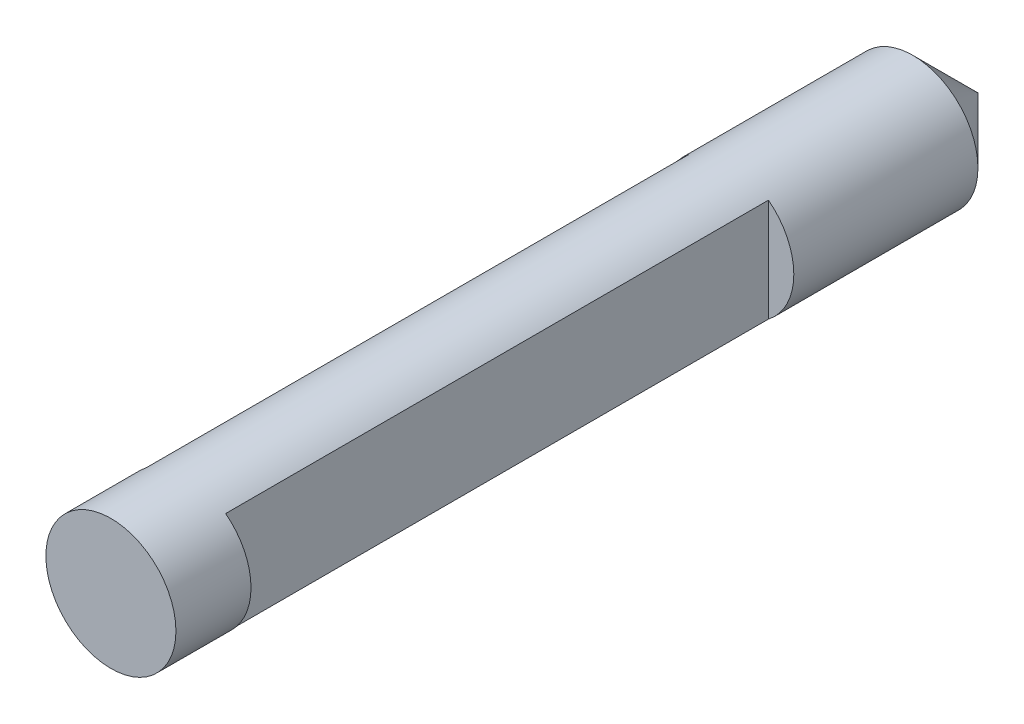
ISO-10303-21;
HEADER;
FILE_DESCRIPTION(('STEP AP214'),'2;1');
FILE_NAME('part.step','',(''),(''),'','','');
FILE_SCHEMA(('AUTOMOTIVE_DESIGN { 1 0 10303 214 1 1 1 1 }'));
ENDSEC;
DATA;
#1=APPLICATION_CONTEXT('core data for automotive mechanical design processes');
#2=APPLICATION_PROTOCOL_DEFINITION('international standard','automotive_design',2000,#1);
#3=PRODUCT_CONTEXT('',#1,'mechanical');
#4=PRODUCT('Part','Part','',(#3));
#5=PRODUCT_RELATED_PRODUCT_CATEGORY('part','',(#4));
#6=PRODUCT_DEFINITION_FORMATION('','',#4);
#7=PRODUCT_DEFINITION_CONTEXT('part definition',#1,'design');
#8=PRODUCT_DEFINITION('design','',#6,#7);
#9=PRODUCT_DEFINITION_SHAPE('','',#8);
#10=(LENGTH_UNIT() NAMED_UNIT(*) SI_UNIT(.MILLI.,.METRE.));
#11=(NAMED_UNIT(*) PLANE_ANGLE_UNIT() SI_UNIT($,.RADIAN.));
#12=(NAMED_UNIT(*) SI_UNIT($,.STERADIAN.) SOLID_ANGLE_UNIT());
#13=UNCERTAINTY_MEASURE_WITH_UNIT(LENGTH_MEASURE(1.E-05),#10,'distance_accuracy_value','');
#14=(GEOMETRIC_REPRESENTATION_CONTEXT(3) GLOBAL_UNCERTAINTY_ASSIGNED_CONTEXT((#13)) GLOBAL_UNIT_ASSIGNED_CONTEXT((#10,
#11,#12)) REPRESENTATION_CONTEXT('',''));
#15=CARTESIAN_POINT('',(0.,0.,0.));
#16=DIRECTION('',(0.,0.,1.));
#17=DIRECTION('',(1.,0.,0.));
#18=AXIS2_PLACEMENT_3D('',#15,#16,#17);
#19=CARTESIAN_POINT('',(0.,0.,50.));
#20=DIRECTION('',(0.,0.,-1.));
#21=DIRECTION('',(-1.,0.,0.));
#22=AXIS2_PLACEMENT_3D('',#19,#20,#21);
#23=CYLINDRICAL_SURFACE('',#22,3.75);
#24=CARTESIAN_POINT('',(0.,0.,14.3691275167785));
#25=DIRECTION('',(0.,0.,1.));
#26=DIRECTION('',(1.,0.,0.));
#27=AXIS2_PLACEMENT_3D('',#24,#25,#26);
#28=CIRCLE('',#27,3.75);
#29=CARTESIAN_POINT('',(2.28859060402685,-2.9706654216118,14.3691275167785));
#30=VERTEX_POINT('',#29);
#31=CARTESIAN_POINT('',(2.28859060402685,2.9706654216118,14.3691275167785));
#32=VERTEX_POINT('',#31);
#33=EDGE_CURVE('E86',#30,#32,#28,.T.);
#34=ORIENTED_EDGE('',*,*,#33,.F.);
#35=DIRECTION('',(0.,0.,-1.));
#36=VECTOR('',#35,1.);
#37=CARTESIAN_POINT('',(2.28859060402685,-2.9706654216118,50.));
#38=LINE('',#37,#36);
#39=CARTESIAN_POINT('',(2.28859060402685,-2.9706654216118,45.6711409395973));
#40=VERTEX_POINT('',#39);
#41=EDGE_CURVE('E88',#40,#30,#38,.T.);
#42=ORIENTED_EDGE('',*,*,#41,.F.);
#43=CARTESIAN_POINT('',(0.,0.,45.6711409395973));
#44=DIRECTION('',(0.,0.,-1.));
#45=DIRECTION('',(-1.,0.,0.));
#46=AXIS2_PLACEMENT_3D('',#43,#44,#45);
#47=CIRCLE('',#46,3.75);
#48=CARTESIAN_POINT('',(2.28859060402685,2.9706654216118,45.6711409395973));
#49=VERTEX_POINT('',#48);
#50=EDGE_CURVE('E92',#49,#40,#47,.T.);
#51=ORIENTED_EDGE('',*,*,#50,.F.);
#52=DIRECTION('',(0.,0.,-1.));
#53=VECTOR('',#52,1.);
#54=CARTESIAN_POINT('',(2.28859060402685,2.9706654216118,50.));
#55=LINE('',#54,#53);
#56=EDGE_CURVE('E90',#32,#49,#55,.F.);
#57=ORIENTED_EDGE('',*,*,#56,.F.);
#58=EDGE_LOOP('',(#34,#42,#51,#57));
#59=FACE_BOUND('',#58,.T.);
#60=CARTESIAN_POINT('',(0.,0.,3.75000000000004));
#61=DIRECTION('',(0.,0.,-1.));
#62=DIRECTION('',(-1.,0.,0.));
#63=AXIS2_PLACEMENT_3D('',#60,#61,#62);
#64=CIRCLE('',#63,3.75);
#65=CARTESIAN_POINT('',(3.75,0.,3.75000000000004));
#66=VERTEX_POINT('',#65);
#67=EDGE_CURVE('E98',#66,#66,#64,.T.);
#68=ORIENTED_EDGE('',*,*,#67,.F.);
#69=EDGE_LOOP('',(#68));
#70=FACE_BOUND('',#69,.T.);
#71=CARTESIAN_POINT('',(0.,0.,50.));
#72=DIRECTION('',(0.,0.,1.));
#73=DIRECTION('',(1.,0.,0.));
#74=AXIS2_PLACEMENT_3D('',#71,#72,#73);
#75=CIRCLE('',#74,3.75);
#76=CARTESIAN_POINT('',(3.75,0.,50.));
#77=VERTEX_POINT('',#76);
#78=EDGE_CURVE('E94',#77,#77,#75,.T.);
#79=ORIENTED_EDGE('',*,*,#78,.F.);
#80=EDGE_LOOP('',(#79));
#81=FACE_BOUND('',#80,.T.);
#82=DIRECTION('',(0.,0.,-1.));
#83=VECTOR('',#82,1.);
#84=CARTESIAN_POINT('',(-2.28859060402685,2.9706654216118,50.));
#85=LINE('',#84,#83);
#86=CARTESIAN_POINT('',(-2.28859060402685,2.9706654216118,45.6711409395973));
#87=VERTEX_POINT('',#86);
#88=CARTESIAN_POINT('',(-2.28859060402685,2.9706654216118,14.3691275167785));
#89=VERTEX_POINT('',#88);
#90=EDGE_CURVE('E11',#87,#89,#85,.T.);
#91=ORIENTED_EDGE('',*,*,#90,.F.);
#92=CARTESIAN_POINT('',(0.,0.,45.6711409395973));
#93=DIRECTION('',(0.,0.,-1.));
#94=DIRECTION('',(-1.,0.,0.));
#95=AXIS2_PLACEMENT_3D('',#92,#93,#94);
#96=CIRCLE('',#95,3.75);
#97=CARTESIAN_POINT('',(-2.28859060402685,-2.9706654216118,45.6711409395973));
#98=VERTEX_POINT('',#97);
#99=EDGE_CURVE('E71',#98,#87,#96,.T.);
#100=ORIENTED_EDGE('',*,*,#99,.F.);
#101=DIRECTION('',(0.,0.,-1.));
#102=VECTOR('',#101,1.);
#103=CARTESIAN_POINT('',(-2.28859060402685,-2.9706654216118,50.));
#104=LINE('',#103,#102);
#105=CARTESIAN_POINT('',(-2.28859060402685,-2.9706654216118,14.3691275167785));
#106=VERTEX_POINT('',#105);
#107=EDGE_CURVE('E78',#106,#98,#104,.F.);
#108=ORIENTED_EDGE('',*,*,#107,.F.);
#109=CARTESIAN_POINT('',(0.,0.,14.3691275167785));
#110=DIRECTION('',(0.,0.,1.));
#111=DIRECTION('',(1.,0.,0.));
#112=AXIS2_PLACEMENT_3D('',#109,#110,#111);
#113=CIRCLE('',#112,3.75);
#114=EDGE_CURVE('E39',#89,#106,#113,.T.);
#115=ORIENTED_EDGE('',*,*,#114,.F.);
#116=EDGE_LOOP('',(#91,#100,#108,#115));
#117=FACE_BOUND('',#116,.T.);
#118=ADVANCED_FACE('F32',(#59,#70,#81,#117),#23,.T.);
#119=CARTESIAN_POINT('',(0.,0.,50.));
#120=DIRECTION('',(0.,0.,1.));
#121=DIRECTION('',(1.,0.,0.));
#122=AXIS2_PLACEMENT_3D('',#119,#120,#121);
#123=PLANE('',#122);
#124=ORIENTED_EDGE('',*,*,#78,.T.);
#125=EDGE_LOOP('',(#124));
#126=FACE_BOUND('',#125,.T.);
#127=ADVANCED_FACE('F134',(#126),#123,.T.);
#128=CARTESIAN_POINT('',(0.,0.,-0.00104482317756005));
#129=DIRECTION('',(0.,0.,-1.));
#130=DIRECTION('',(-1.,0.,0.));
#131=AXIS2_PLACEMENT_3D('',#128,#129,#130);
#132=TOROIDAL_SURFACE('',#131,0.0130973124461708,0.00999999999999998);
#133=CARTESIAN_POINT('',(0.,0.,0.00602624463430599));
#134=DIRECTION('',(0.,0.,-1.));
#135=DIRECTION('',(-1.,0.,0.));
#136=AXIS2_PLACEMENT_3D('',#133,#134,#135);
#137=CIRCLE('',#136,0.00602624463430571);
#138=CARTESIAN_POINT('',(0.00602624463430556,0.,0.00602624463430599));
#139=VERTEX_POINT('',#138);
#140=EDGE_CURVE('E103',#139,#139,#137,.T.);
#141=ORIENTED_EDGE('',*,*,#140,.T.);
#142=EDGE_LOOP('',(#141));
#143=FACE_BOUND('',#142,.T.);
#144=CARTESIAN_POINT('',(0.,0.,0.));
#145=DIRECTION('',(0.,0.,-1.));
#146=DIRECTION('',(-1.,0.,0.));
#147=AXIS2_PLACEMENT_3D('',#144,#145,#146);
#148=CIRCLE('',#147,0.00315204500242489);
#149=CARTESIAN_POINT('',(-0.00315204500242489,0.,0.));
#150=VERTEX_POINT('',#149);
#151=EDGE_CURVE('E95',#150,#150,#148,.T.);
#152=ORIENTED_EDGE('',*,*,#151,.F.);
#153=EDGE_LOOP('',(#152));
#154=FACE_BOUND('',#153,.T.);
#155=ADVANCED_FACE('F138',(#143,#154),#132,.F.);
#156=CARTESIAN_POINT('',(0.,0.,3.75000000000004));
#157=DIRECTION('',(0.,0.,1.));
#158=DIRECTION('',(1.,0.,0.));
#159=AXIS2_PLACEMENT_3D('',#156,#157,#158);
#160=CONICAL_SURFACE('',#159,3.75,0.785398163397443);
#161=CARTESIAN_POINT('',(0.00602624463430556,0.,0.00602624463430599));
#162=CARTESIAN_POINT('',(0.0450259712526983,0.,0.0450259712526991));
#163=CARTESIAN_POINT('',(0.084025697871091,0.,0.0840256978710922));
#164=CARTESIAN_POINT('',(0.162025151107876,0.,0.162025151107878));
#165=CARTESIAN_POINT('',(0.201024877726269,0.,0.201024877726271));
#166=CARTESIAN_POINT('',(0.279024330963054,0.,0.279024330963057));
#167=CARTESIAN_POINT('',(0.318024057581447,0.,0.31802405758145));
#168=CARTESIAN_POINT('',(0.396023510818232,0.,0.396023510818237));
#169=CARTESIAN_POINT('',(0.435023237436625,0.,0.43502323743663));
#170=CARTESIAN_POINT('',(0.51302269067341,0.,0.513022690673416));
#171=CARTESIAN_POINT('',(0.552022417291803,0.,0.552022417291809));
#172=CARTESIAN_POINT('',(0.630021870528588,0.,0.630021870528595));
#173=CARTESIAN_POINT('',(0.669021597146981,0.,0.669021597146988));
#174=CARTESIAN_POINT('',(0.747021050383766,0.,0.747021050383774));
#175=CARTESIAN_POINT('',(0.786020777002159,0.,0.786020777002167));
#176=CARTESIAN_POINT('',(0.864020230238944,0.,0.864020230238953));
#177=CARTESIAN_POINT('',(0.903019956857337,0.,0.903019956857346));
#178=CARTESIAN_POINT('',(0.981019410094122,0.,0.981019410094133));
#179=CARTESIAN_POINT('',(1.02001913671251,0.,1.02001913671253));
#180=CARTESIAN_POINT('',(1.0980185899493,0.,1.09801858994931));
#181=CARTESIAN_POINT('',(1.13701831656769,0.,1.13701831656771));
#182=CARTESIAN_POINT('',(1.21501776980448,0.,1.21501776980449));
#183=CARTESIAN_POINT('',(1.25401749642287,0.,1.25401749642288));
#184=CARTESIAN_POINT('',(1.33201694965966,0.,1.33201694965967));
#185=CARTESIAN_POINT('',(1.37101667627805,0.,1.37101667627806));
#186=CARTESIAN_POINT('',(1.44901612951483,0.,1.44901612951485));
#187=CARTESIAN_POINT('',(1.48801585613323,0.,1.48801585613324));
#188=CARTESIAN_POINT('',(1.56601530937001,0.,1.56601530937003));
#189=CARTESIAN_POINT('',(1.6050150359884,0.,1.60501503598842));
#190=CARTESIAN_POINT('',(1.68301448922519,0.,1.68301448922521));
#191=CARTESIAN_POINT('',(1.72201421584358,0.,1.7220142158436));
#192=CARTESIAN_POINT('',(1.80001366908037,0.,1.80001366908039));
#193=CARTESIAN_POINT('',(1.83901339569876,0.,1.83901339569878));
#194=CARTESIAN_POINT('',(1.91701284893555,0.,1.91701284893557));
#195=CARTESIAN_POINT('',(1.95601257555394,0.,1.95601257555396));
#196=CARTESIAN_POINT('',(2.03401202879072,0.,2.03401202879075));
#197=CARTESIAN_POINT('',(2.07301175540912,0.,2.07301175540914));
#198=CARTESIAN_POINT('',(2.1510112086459,0.,2.15101120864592));
#199=CARTESIAN_POINT('',(2.19001093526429,0.,2.19001093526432));
#200=CARTESIAN_POINT('',(2.26801038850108,0.,2.2680103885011));
#201=CARTESIAN_POINT('',(2.30701011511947,0.,2.3070101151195));
#202=CARTESIAN_POINT('',(2.38500956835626,0.,2.38500956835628));
#203=CARTESIAN_POINT('',(2.42400929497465,0.,2.42400929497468));
#204=CARTESIAN_POINT('',(2.50200874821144,0.,2.50200874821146));
#205=CARTESIAN_POINT('',(2.54100847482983,0.,2.54100847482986));
#206=CARTESIAN_POINT('',(2.61900792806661,0.,2.61900792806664));
#207=CARTESIAN_POINT('',(2.65800765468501,0.,2.65800765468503));
#208=CARTESIAN_POINT('',(2.73600710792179,0.,2.73600710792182));
#209=CARTESIAN_POINT('',(2.77500683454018,0.,2.77500683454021));
#210=CARTESIAN_POINT('',(2.85300628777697,0.,2.853006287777));
#211=CARTESIAN_POINT('',(2.89200601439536,0.,2.89200601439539));
#212=CARTESIAN_POINT('',(2.97000546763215,0.,2.97000546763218));
#213=CARTESIAN_POINT('',(3.00900519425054,0.,3.00900519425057));
#214=CARTESIAN_POINT('',(3.08700464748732,0.,3.08700464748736));
#215=CARTESIAN_POINT('',(3.12600437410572,0.,3.12600437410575));
#216=CARTESIAN_POINT('',(3.2040038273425,0.,3.20400382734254));
#217=CARTESIAN_POINT('',(3.2430035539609,0.,3.24300355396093));
#218=CARTESIAN_POINT('',(3.32100300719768,0.,3.32100300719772));
#219=CARTESIAN_POINT('',(3.36000273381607,0.,3.36000273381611));
#220=CARTESIAN_POINT('',(3.43800218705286,0.,3.4380021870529));
#221=CARTESIAN_POINT('',(3.47700191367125,0.,3.47700191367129));
#222=CARTESIAN_POINT('',(3.55500136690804,0.,3.55500136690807));
#223=CARTESIAN_POINT('',(3.59400109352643,0.,3.59400109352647));
#224=CARTESIAN_POINT('',(3.67200054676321,0.,3.67200054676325));
#225=CARTESIAN_POINT('',(3.71100027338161,0.,3.71100027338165));
#226=CARTESIAN_POINT('',(3.75,0.,3.75000000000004));
#227=B_SPLINE_CURVE_WITH_KNOTS('',3,(#161,#162,#163,#164,#165,#166,#167,#168,#169,#170,#171,
#172,#173,#174,#175,#176,#177,#178,#179,#180,#181,#182,#183,#184,#185,#186,#187,#188,#189,#190,
#191,#192,#193,#194,#195,#196,#197,#198,#199,#200,#201,#202,#203,#204,#205,#206,#207,#208,#209,
#210,#211,#212,#213,#214,#215,#216,#217,#218,#219,#220,#221,#222,#223,#224,#225,#226),
.UNSPECIFIED.,.F.,.F.,(4,2,2,2,2,2,2,2,2,2,2,2,2,2,2,2,2,2,2,2,2,2,2,2,2,2,2,2,2,2,2,2,4),(0.,
0.165461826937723,0.330923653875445,0.496385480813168,0.66184730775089,0.827309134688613,
0.992770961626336,1.15823278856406,1.32369461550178,1.4891564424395,1.65461826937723,
1.82008009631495,1.98554192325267,2.15100375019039,2.31646557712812,2.48192740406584,
2.64738923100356,2.81285105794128,2.97831288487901,3.14377471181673,3.30923653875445,
3.47469836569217,3.6401601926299,3.80562201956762,3.97108384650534,4.13654567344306,
4.30200750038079,4.46746932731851,4.63293115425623,4.79839298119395,4.96385480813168,
5.1293166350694,5.29477846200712),.UNSPECIFIED.);
#228=EDGE_CURVE('BSEAM130',#139,#66,#227,.T.);
#229=ORIENTED_EDGE('',*,*,#140,.F.);
#230=ORIENTED_EDGE('',*,*,#67,.T.);
#231=ORIENTED_EDGE('',*,*,#228,.T.);
#232=ORIENTED_EDGE('',*,*,#228,.F.);
#233=EDGE_LOOP('',(#229,#231,#230,#232));
#234=FACE_BOUND('',#233,.T.);
#235=ADVANCED_FACE('F130',(#234),#160,.T.);
#236=CARTESIAN_POINT('',(0.,0.,0.));
#237=DIRECTION('',(0.,0.,1.));
#238=DIRECTION('',(1.,0.,0.));
#239=AXIS2_PLACEMENT_3D('',#236,#237,#238);
#240=PLANE('',#239);
#241=ORIENTED_EDGE('',*,*,#151,.T.);
#242=EDGE_LOOP('',(#241));
#243=FACE_BOUND('',#242,.T.);
#244=ADVANCED_FACE('F122',(#243),#240,.F.);
#245=CARTESIAN_POINT('',(5.38926174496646,50.,14.3691275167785));
#246=DIRECTION('',(0.,0.,1.));
#247=DIRECTION('',(1.,0.,0.));
#248=AXIS2_PLACEMENT_3D('',#245,#246,#247);
#249=PLANE('',#248);
#250=ORIENTED_EDGE('',*,*,#33,.T.);
#251=DIRECTION('',(0.,-1.,0.));
#252=VECTOR('',#251,1.);
#253=CARTESIAN_POINT('',(2.28859060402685,50.,14.3691275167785));
#254=LINE('',#253,#252);
#255=EDGE_CURVE('E106',#32,#30,#254,.T.);
#256=ORIENTED_EDGE('',*,*,#255,.T.);
#257=EDGE_LOOP('',(#250,#256));
#258=FACE_BOUND('',#257,.T.);
#259=ADVANCED_FACE('F120',(#258),#249,.T.);
#260=CARTESIAN_POINT('',(2.28859060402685,50.,14.3691275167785));
#261=DIRECTION('',(1.,0.,0.));
#262=DIRECTION('',(0.,0.,-1.));
#263=AXIS2_PLACEMENT_3D('',#260,#261,#262);
#264=PLANE('',#263);
#265=ORIENTED_EDGE('',*,*,#41,.T.);
#266=ORIENTED_EDGE('',*,*,#255,.F.);
#267=ORIENTED_EDGE('',*,*,#56,.T.);
#268=DIRECTION('',(0.,-1.,0.));
#269=VECTOR('',#268,1.);
#270=CARTESIAN_POINT('',(2.28859060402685,50.,45.6711409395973));
#271=LINE('',#270,#269);
#272=EDGE_CURVE('E52',#49,#40,#271,.T.);
#273=ORIENTED_EDGE('',*,*,#272,.T.);
#274=EDGE_LOOP('',(#265,#266,#267,#273));
#275=FACE_BOUND('',#274,.T.);
#276=ADVANCED_FACE('F112',(#275),#264,.T.);
#277=CARTESIAN_POINT('',(5.38926174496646,50.,45.6711409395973));
#278=DIRECTION('',(0.,0.,-1.));
#279=DIRECTION('',(-1.,0.,0.));
#280=AXIS2_PLACEMENT_3D('',#277,#278,#279);
#281=PLANE('',#280);
#282=ORIENTED_EDGE('',*,*,#50,.T.);
#283=ORIENTED_EDGE('',*,*,#272,.F.);
#284=EDGE_LOOP('',(#282,#283));
#285=FACE_BOUND('',#284,.T.);
#286=ADVANCED_FACE('F128',(#285),#281,.T.);
#287=CARTESIAN_POINT('',(-5.38926174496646,50.,14.3691275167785));
#288=DIRECTION('',(0.,0.,1.));
#289=DIRECTION('',(1.,0.,0.));
#290=AXIS2_PLACEMENT_3D('',#287,#288,#289);
#291=PLANE('',#290);
#292=ORIENTED_EDGE('',*,*,#114,.T.);
#293=DIRECTION('',(0.,-1.,0.));
#294=VECTOR('',#293,1.);
#295=CARTESIAN_POINT('',(-2.28859060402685,50.,14.3691275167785));
#296=LINE('',#295,#294);
#297=EDGE_CURVE('E45',#89,#106,#296,.T.);
#298=ORIENTED_EDGE('',*,*,#297,.F.);
#299=EDGE_LOOP('',(#292,#298));
#300=FACE_BOUND('',#299,.T.);
#301=ADVANCED_FACE('F188',(#300),#291,.T.);
#302=CARTESIAN_POINT('',(-5.38926174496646,50.,45.6711409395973));
#303=DIRECTION('',(0.,0.,-1.));
#304=DIRECTION('',(-1.,0.,0.));
#305=AXIS2_PLACEMENT_3D('',#302,#303,#304);
#306=PLANE('',#305);
#307=ORIENTED_EDGE('',*,*,#99,.T.);
#308=DIRECTION('',(0.,-1.,0.));
#309=VECTOR('',#308,1.);
#310=CARTESIAN_POINT('',(-2.28859060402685,50.,45.6711409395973));
#311=LINE('',#310,#309);
#312=EDGE_CURVE('E74',#87,#98,#311,.T.);
#313=ORIENTED_EDGE('',*,*,#312,.T.);
#314=EDGE_LOOP('',(#307,#313));
#315=FACE_BOUND('',#314,.T.);
#316=ADVANCED_FACE('F73',(#315),#306,.T.);
#317=CARTESIAN_POINT('',(-2.28859060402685,50.,14.3691275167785));
#318=DIRECTION('',(-1.,0.,0.));
#319=DIRECTION('',(0.,0.,1.));
#320=AXIS2_PLACEMENT_3D('',#317,#318,#319);
#321=PLANE('',#320);
#322=ORIENTED_EDGE('',*,*,#90,.T.);
#323=ORIENTED_EDGE('',*,*,#297,.T.);
#324=ORIENTED_EDGE('',*,*,#107,.T.);
#325=ORIENTED_EDGE('',*,*,#312,.F.);
#326=EDGE_LOOP('',(#322,#323,#324,#325));
#327=FACE_BOUND('',#326,.T.);
#328=ADVANCED_FACE('F80',(#327),#321,.T.);
#329=CLOSED_SHELL('',(#118,#127,#155,#235,#244,#259,#276,#286,#301,#316,#328));
#330=MANIFOLD_SOLID_BREP('B2',#329);
#331=ADVANCED_BREP_SHAPE_REPRESENTATION('',(#18,#330),#14);
#332=SHAPE_DEFINITION_REPRESENTATION(#9,#331);
ENDSEC;
END-ISO-10303-21;
